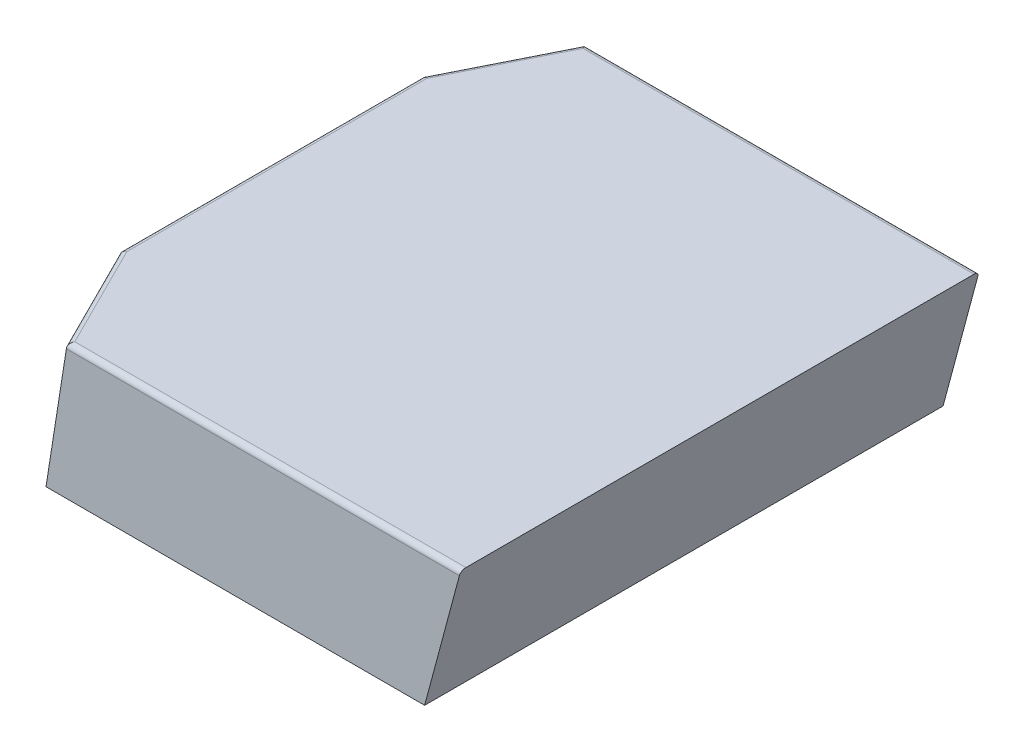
ISO-10303-21;
HEADER;
FILE_DESCRIPTION(('STEP AP214'),'2;1');
FILE_NAME('part.step','',(''),(''),'','','');
FILE_SCHEMA(('AUTOMOTIVE_DESIGN { 1 0 10303 214 1 1 1 1 }'));
ENDSEC;
DATA;
#1=APPLICATION_CONTEXT('core data for automotive mechanical design processes');
#2=APPLICATION_PROTOCOL_DEFINITION('international standard','automotive_design',2000,#1);
#3=PRODUCT_CONTEXT('',#1,'mechanical');
#4=PRODUCT('Part','Part','',(#3));
#5=PRODUCT_RELATED_PRODUCT_CATEGORY('part','',(#4));
#6=PRODUCT_DEFINITION_FORMATION('','',#4);
#7=PRODUCT_DEFINITION_CONTEXT('part definition',#1,'design');
#8=PRODUCT_DEFINITION('design','',#6,#7);
#9=PRODUCT_DEFINITION_SHAPE('','',#8);
#10=(LENGTH_UNIT() NAMED_UNIT(*) SI_UNIT(.MILLI.,.METRE.));
#11=(NAMED_UNIT(*) PLANE_ANGLE_UNIT() SI_UNIT($,.RADIAN.));
#12=(NAMED_UNIT(*) SI_UNIT($,.STERADIAN.) SOLID_ANGLE_UNIT());
#13=UNCERTAINTY_MEASURE_WITH_UNIT(LENGTH_MEASURE(1.E-05),#10,'distance_accuracy_value','');
#14=(GEOMETRIC_REPRESENTATION_CONTEXT(3) GLOBAL_UNCERTAINTY_ASSIGNED_CONTEXT((#13)) GLOBAL_UNIT_ASSIGNED_CONTEXT((#10,
#11,#12)) REPRESENTATION_CONTEXT('',''));
#15=CARTESIAN_POINT('',(0.,0.,0.));
#16=DIRECTION('',(0.,0.,1.));
#17=DIRECTION('',(1.,0.,0.));
#18=AXIS2_PLACEMENT_3D('',#15,#16,#17);
#19=CARTESIAN_POINT('',(0.,-260.,1000.));
#20=DIRECTION('',(0.,1.,0.));
#21=DIRECTION('',(0.,0.,1.));
#22=AXIS2_PLACEMENT_3D('',#19,#20,#21);
#23=PLANE('',#22);
#24=DIRECTION('',(0.,0.,-1.));
#25=VECTOR('',#24,1.);
#26=CARTESIAN_POINT('',(0.,-260.,1000.));
#27=LINE('',#26,#25);
#28=CARTESIAN_POINT('',(0.,-260.,800.));
#29=VERTEX_POINT('',#28);
#30=CARTESIAN_POINT('',(0.,-260.,200.));
#31=VERTEX_POINT('',#30);
#32=EDGE_CURVE('E117',#29,#31,#27,.T.);
#33=ORIENTED_EDGE('',*,*,#32,.T.);
#34=DIRECTION('',(-0.447213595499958,0.,0.894427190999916));
#35=VECTOR('',#34,1.);
#36=CARTESIAN_POINT('',(100.,-260.,0.));
#37=LINE('',#36,#35);
#38=CARTESIAN_POINT('',(100.,-260.,0.));
#39=VERTEX_POINT('',#38);
#40=EDGE_CURVE('E127',#39,#31,#37,.T.);
#41=ORIENTED_EDGE('',*,*,#40,.F.);
#42=DIRECTION('',(1.,0.,0.));
#43=VECTOR('',#42,1.);
#44=CARTESIAN_POINT('',(0.,-260.,0.));
#45=LINE('',#44,#43);
#46=CARTESIAN_POINT('',(830.333209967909,-260.,0.));
#47=VERTEX_POINT('',#46);
#48=EDGE_CURVE('E185',#39,#47,#45,.T.);
#49=ORIENTED_EDGE('',*,*,#48,.T.);
#50=DIRECTION('',(0.,0.,-1.));
#51=VECTOR('',#50,1.);
#52=CARTESIAN_POINT('',(830.333209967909,-260.,1000.));
#53=LINE('',#52,#51);
#54=CARTESIAN_POINT('',(830.333209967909,-260.,1000.));
#55=VERTEX_POINT('',#54);
#56=EDGE_CURVE('E137',#55,#47,#53,.T.);
#57=ORIENTED_EDGE('',*,*,#56,.F.);
#58=DIRECTION('',(1.,0.,0.));
#59=VECTOR('',#58,1.);
#60=CARTESIAN_POINT('',(0.,-260.,1000.));
#61=LINE('',#60,#59);
#62=CARTESIAN_POINT('',(100.,-260.,1000.));
#63=VERTEX_POINT('',#62);
#64=EDGE_CURVE('E186',#63,#55,#61,.T.);
#65=ORIENTED_EDGE('',*,*,#64,.F.);
#66=DIRECTION('',(0.447213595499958,0.,0.894427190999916));
#67=VECTOR('',#66,1.);
#68=CARTESIAN_POINT('',(100.,-260.,1000.));
#69=LINE('',#68,#67);
#70=EDGE_CURVE('E132',#29,#63,#69,.T.);
#71=ORIENTED_EDGE('',*,*,#70,.F.);
#72=EDGE_LOOP('',(#33,#41,#49,#57,#65,#71));
#73=FACE_BOUND('',#72,.T.);
#74=ADVANCED_FACE('F33',(#73),#23,.F.);
#75=CARTESIAN_POINT('',(830.333209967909,-260.,1000.));
#76=DIRECTION('',(-0.965925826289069,0.258819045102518,0.));
#77=DIRECTION('',(-0.258819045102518,-0.965925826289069,0.));
#78=AXIS2_PLACEMENT_3D('',#75,#76,#77);
#79=PLANE('',#78);
#80=DIRECTION('',(0.258819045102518,0.965925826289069,0.));
#81=VECTOR('',#80,1.);
#82=CARTESIAN_POINT('',(830.333209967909,-260.,0.));
#83=LINE('',#82,#81);
#84=CARTESIAN_POINT('',(897.320508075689,-9.99999999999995,0.));
#85=VERTEX_POINT('',#84);
#86=EDGE_CURVE('E189',#47,#85,#83,.T.);
#87=ORIENTED_EDGE('',*,*,#86,.T.);
#88=CARTESIAN_POINT('',(897.320508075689,-10.,10.));
#89=DIRECTION('',(-0.965925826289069,0.258819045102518,0.));
#90=DIRECTION('',(-0.258819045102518,-0.965925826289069,0.));
#91=AXIS2_PLACEMENT_3D('',#88,#89,#90);
#92=ELLIPSE('',#91,10.3527618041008,10.);
#93=CARTESIAN_POINT('',(900.,0.,10.));
#94=VERTEX_POINT('',#93);
#95=EDGE_CURVE('E164',#85,#94,#92,.F.);
#96=ORIENTED_EDGE('',*,*,#95,.T.);
#97=DIRECTION('',(0.,0.,-1.));
#98=VECTOR('',#97,1.);
#99=CARTESIAN_POINT('',(900.,0.,1000.));
#100=LINE('',#99,#98);
#101=CARTESIAN_POINT('',(900.,0.,990.));
#102=VERTEX_POINT('',#101);
#103=EDGE_CURVE('E141',#102,#94,#100,.T.);
#104=ORIENTED_EDGE('',*,*,#103,.F.);
#105=CARTESIAN_POINT('',(897.320508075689,-10.,990.));
#106=DIRECTION('',(-0.965925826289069,0.258819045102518,0.));
#107=DIRECTION('',(0.258819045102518,0.965925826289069,0.));
#108=AXIS2_PLACEMENT_3D('',#105,#106,#107);
#109=ELLIPSE('',#108,10.3527618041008,10.);
#110=CARTESIAN_POINT('',(897.320508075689,-9.99999999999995,1000.));
#111=VERTEX_POINT('',#110);
#112=EDGE_CURVE('E162',#102,#111,#109,.F.);
#113=ORIENTED_EDGE('',*,*,#112,.T.);
#114=DIRECTION('',(0.258819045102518,0.965925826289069,0.));
#115=VECTOR('',#114,1.);
#116=CARTESIAN_POINT('',(830.333209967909,-260.,1000.));
#117=LINE('',#116,#115);
#118=EDGE_CURVE('E188',#55,#111,#117,.T.);
#119=ORIENTED_EDGE('',*,*,#118,.F.);
#120=ORIENTED_EDGE('',*,*,#56,.T.);
#121=EDGE_LOOP('',(#87,#96,#104,#113,#119,#120));
#122=FACE_BOUND('',#121,.T.);
#123=ADVANCED_FACE('F217',(#122),#79,.F.);
#124=CARTESIAN_POINT('',(0.,0.,1000.));
#125=DIRECTION('',(0.,-1.,0.));
#126=DIRECTION('',(0.,0.,-1.));
#127=AXIS2_PLACEMENT_3D('',#124,#125,#126);
#128=PLANE('',#127);
#129=ORIENTED_EDGE('',*,*,#103,.T.);
#130=DIRECTION('',(-1.,0.,0.));
#131=VECTOR('',#130,1.);
#132=CARTESIAN_POINT('',(0.,0.,10.));
#133=LINE('',#132,#131);
#134=CARTESIAN_POINT('',(145.572572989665,0.,10.));
#135=VERTEX_POINT('',#134);
#136=EDGE_CURVE('E153',#94,#135,#133,.T.);
#137=ORIENTED_EDGE('',*,*,#136,.T.);
#138=DIRECTION('',(-0.447213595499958,0.,0.894427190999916));
#139=VECTOR('',#138,1.);
#140=CARTESIAN_POINT('',(-279.541941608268,0.,860.229029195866));
#141=LINE('',#140,#139);
#142=CARTESIAN_POINT('',(45.2334844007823,0.,210.678177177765));
#143=VERTEX_POINT('',#142);
#144=EDGE_CURVE('E151',#135,#143,#141,.T.);
#145=ORIENTED_EDGE('',*,*,#144,.T.);
#146=DIRECTION('',(0.,0.,1.));
#147=VECTOR('',#146,1.);
#148=CARTESIAN_POINT('',(45.2334844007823,0.,1000.));
#149=LINE('',#148,#147);
#150=CARTESIAN_POINT('',(45.2334844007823,0.,789.321822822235));
#151=VERTEX_POINT('',#150);
#152=EDGE_CURVE('E149',#143,#151,#149,.T.);
#153=ORIENTED_EDGE('',*,*,#152,.T.);
#154=DIRECTION('',(0.447213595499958,0.,0.894427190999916));
#155=VECTOR('',#154,1.);
#156=CARTESIAN_POINT('',(120.458058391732,0.,939.770970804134));
#157=LINE('',#156,#155);
#158=CARTESIAN_POINT('',(145.572572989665,0.,990.));
#159=VERTEX_POINT('',#158);
#160=EDGE_CURVE('E147',#151,#159,#157,.T.);
#161=ORIENTED_EDGE('',*,*,#160,.T.);
#162=DIRECTION('',(-1.,0.,0.));
#163=VECTOR('',#162,1.);
#164=CARTESIAN_POINT('',(900.,0.,990.));
#165=LINE('',#164,#163);
#166=EDGE_CURVE('E123',#159,#102,#165,.F.);
#167=ORIENTED_EDGE('',*,*,#166,.T.);
#168=EDGE_LOOP('',(#129,#137,#145,#153,#161,#167));
#169=FACE_BOUND('',#168,.T.);
#170=ADVANCED_FACE('F197',(#169),#128,.F.);
#171=CARTESIAN_POINT('',(0.,0.,1000.));
#172=DIRECTION('',(0.,0.,1.));
#173=DIRECTION('',(1.,0.,0.));
#174=AXIS2_PLACEMENT_3D('',#171,#172,#173);
#175=PLANE('',#174);
#176=ORIENTED_EDGE('',*,*,#118,.T.);
#177=DIRECTION('',(-1.,0.,0.));
#178=VECTOR('',#177,1.);
#179=CARTESIAN_POINT('',(140.853651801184,-10.,1000.));
#180=LINE('',#179,#178);
#181=CARTESIAN_POINT('',(139.282357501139,-10.,1000.));
#182=VERTEX_POINT('',#181);
#183=EDGE_CURVE('E11',#111,#182,#180,.T.);
#184=ORIENTED_EDGE('',*,*,#183,.T.);
#185=DIRECTION('',(0.155224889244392,0.987879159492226,0.));
#186=VECTOR('',#185,1.);
#187=CARTESIAN_POINT('',(137.459815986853,-21.5989825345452,1000.));
#188=LINE('',#187,#186);
#189=EDGE_CURVE('E136',#63,#182,#188,.T.);
#190=ORIENTED_EDGE('',*,*,#189,.F.);
#191=ORIENTED_EDGE('',*,*,#64,.T.);
#192=EDGE_LOOP('',(#176,#184,#190,#191));
#193=FACE_BOUND('',#192,.T.);
#194=ADVANCED_FACE('F218',(#193),#175,.T.);
#195=CARTESIAN_POINT('',(0.,0.,0.));
#196=DIRECTION('',(0.,0.,1.));
#197=DIRECTION('',(1.,0.,0.));
#198=AXIS2_PLACEMENT_3D('',#195,#196,#197);
#199=PLANE('',#198);
#200=DIRECTION('',(0.155224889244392,0.987879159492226,0.));
#201=VECTOR('',#200,1.);
#202=CARTESIAN_POINT('',(137.459815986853,-21.5989825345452,0.));
#203=LINE('',#202,#201);
#204=CARTESIAN_POINT('',(139.282357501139,-10.,0.));
#205=VERTEX_POINT('',#204);
#206=EDGE_CURVE('E124',#39,#205,#203,.T.);
#207=ORIENTED_EDGE('',*,*,#206,.T.);
#208=DIRECTION('',(-1.,0.,0.));
#209=VECTOR('',#208,1.);
#210=CARTESIAN_POINT('',(0.,-10.,0.));
#211=LINE('',#210,#209);
#212=EDGE_CURVE('E160',#205,#85,#211,.F.);
#213=ORIENTED_EDGE('',*,*,#212,.T.);
#214=ORIENTED_EDGE('',*,*,#86,.F.);
#215=ORIENTED_EDGE('',*,*,#48,.F.);
#216=EDGE_LOOP('',(#207,#213,#214,#215));
#217=FACE_BOUND('',#216,.T.);
#218=ADVANCED_FACE('F213',(#217),#199,.F.);
#219=CARTESIAN_POINT('',(100.,-260.,1000.));
#220=DIRECTION('',(0.885722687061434,-0.139173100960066,-0.442861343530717));
#221=DIRECTION('',(-0.447213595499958,0.,-0.894427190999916));
#222=AXIS2_PLACEMENT_3D('',#219,#220,#221);
#223=PLANE('',#222);
#224=CARTESIAN_POINT('',(134.282357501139,-10.,990.));
#225=DIRECTION('',(0.885722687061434,-0.139173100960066,-0.442861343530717));
#226=DIRECTION('',(0.464214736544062,0.265542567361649,0.844980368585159));
#227=AXIS2_PLACEMENT_3D('',#224,#225,#226);
#228=ELLIPSE('',#227,11.2902154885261,10.);
#229=CARTESIAN_POINT('',(139.452379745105,-8.60826899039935,999.902680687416));
#230=VERTEX_POINT('',#229);
#231=EDGE_CURVE('E50',#182,#230,#228,.F.);
#232=ORIENTED_EDGE('',*,*,#231,.T.);
#233=DIRECTION('',(0.447213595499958,0.,0.894427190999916));
#234=VECTOR('',#233,1.);
#235=CARTESIAN_POINT('',(131.600831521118,-8.6082689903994,984.199584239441));
#236=LINE('',#235,#234);
#237=CARTESIAN_POINT('',(35.3308037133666,-8.60826899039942,791.659528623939));
#238=VERTEX_POINT('',#237);
#239=EDGE_CURVE('E42',#230,#238,#236,.F.);
#240=ORIENTED_EDGE('',*,*,#239,.T.);
#241=DIRECTION('',(-0.139098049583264,-0.989734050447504,0.0328365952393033));
#242=VECTOR('',#241,1.);
#243=CARTESIAN_POINT('',(1.02132546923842,-252.732891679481,799.758897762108));
#244=LINE('',#243,#242);
#245=EDGE_CURVE('E133',#238,#29,#244,.T.);
#246=ORIENTED_EDGE('',*,*,#245,.T.);
#247=ORIENTED_EDGE('',*,*,#70,.T.);
#248=ORIENTED_EDGE('',*,*,#189,.T.);
#249=EDGE_LOOP('',(#232,#240,#246,#247,#248));
#250=FACE_BOUND('',#249,.T.);
#251=ADVANCED_FACE('F221',(#250),#223,.F.);
#252=CARTESIAN_POINT('',(100.,-260.,0.));
#253=DIRECTION('',(0.885722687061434,-0.139173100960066,0.442861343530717));
#254=DIRECTION('',(0.447213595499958,0.,-0.894427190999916));
#255=AXIS2_PLACEMENT_3D('',#252,#253,#254);
#256=PLANE('',#255);
#257=DIRECTION('',(-0.447213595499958,0.,0.894427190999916));
#258=VECTOR('',#257,1.);
#259=CARTESIAN_POINT('',(131.600831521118,-8.60826899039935,15.8004157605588));
#260=LINE('',#259,#258);
#261=CARTESIAN_POINT('',(35.3308037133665,-8.60826899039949,208.340471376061));
#262=VERTEX_POINT('',#261);
#263=CARTESIAN_POINT('',(139.452379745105,-8.60826899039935,0.0973193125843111));
#264=VERTEX_POINT('',#263);
#265=EDGE_CURVE('E156',#262,#264,#260,.F.);
#266=ORIENTED_EDGE('',*,*,#265,.T.);
#267=CARTESIAN_POINT('',(134.282357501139,-10.,10.));
#268=DIRECTION('',(0.885722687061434,-0.139173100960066,0.442861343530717));
#269=DIRECTION('',(-0.464214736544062,-0.265542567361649,0.844980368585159));
#270=AXIS2_PLACEMENT_3D('',#267,#268,#269);
#271=ELLIPSE('',#270,11.2902154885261,10.);
#272=EDGE_CURVE('E158',#264,#205,#271,.F.);
#273=ORIENTED_EDGE('',*,*,#272,.T.);
#274=ORIENTED_EDGE('',*,*,#206,.F.);
#275=ORIENTED_EDGE('',*,*,#40,.T.);
#276=DIRECTION('',(0.139098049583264,0.989734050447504,0.0328365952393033));
#277=VECTOR('',#276,1.);
#278=CARTESIAN_POINT('',(1.02132546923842,-252.732891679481,200.241102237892));
#279=LINE('',#278,#277);
#280=EDGE_CURVE('E112',#31,#262,#279,.T.);
#281=ORIENTED_EDGE('',*,*,#280,.T.);
#282=EDGE_LOOP('',(#266,#273,#274,#275,#281));
#283=FACE_BOUND('',#282,.T.);
#284=ADVANCED_FACE('F128',(#283),#256,.F.);
#285=CARTESIAN_POINT('',(0.,-260.,0.));
#286=DIRECTION('',(0.990268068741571,-0.139173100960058,0.));
#287=DIRECTION('',(0.139173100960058,0.990268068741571,0.));
#288=AXIS2_PLACEMENT_3D('',#285,#286,#287);
#289=PLANE('',#288);
#290=ORIENTED_EDGE('',*,*,#245,.F.);
#291=DIRECTION('',(0.,0.,1.));
#292=VECTOR('',#291,1.);
#293=CARTESIAN_POINT('',(35.3308037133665,-8.6082689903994,0.));
#294=LINE('',#293,#292);
#295=EDGE_CURVE('E120',#238,#262,#294,.F.);
#296=ORIENTED_EDGE('',*,*,#295,.T.);
#297=ORIENTED_EDGE('',*,*,#280,.F.);
#298=ORIENTED_EDGE('',*,*,#32,.F.);
#299=EDGE_LOOP('',(#290,#296,#297,#298));
#300=FACE_BOUND('',#299,.T.);
#301=ADVANCED_FACE('F115',(#300),#289,.F.);
#302=CARTESIAN_POINT('',(0.,-10.,990.));
#303=DIRECTION('',(1.,0.,0.));
#304=DIRECTION('',(0.,0.,-1.));
#305=AXIS2_PLACEMENT_3D('',#302,#303,#304);
#306=CYLINDRICAL_SURFACE('',#305,10.);
#307=ORIENTED_EDGE('',*,*,#112,.F.);
#308=ORIENTED_EDGE('',*,*,#166,.F.);
#309=CARTESIAN_POINT('',(145.572572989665,-10.,990.));
#310=DIRECTION('',(0.85065080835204,0.,0.525731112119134));
#311=DIRECTION('',(0.525731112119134,0.,-0.85065080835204));
#312=AXIS2_PLACEMENT_3D('',#309,#310,#311);
#313=ELLIPSE('',#312,11.7557050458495,10.);
#314=EDGE_CURVE('E37',#230,#159,#313,.F.);
#315=ORIENTED_EDGE('',*,*,#314,.F.);
#316=ORIENTED_EDGE('',*,*,#231,.F.);
#317=ORIENTED_EDGE('',*,*,#183,.F.);
#318=EDGE_LOOP('',(#307,#308,#315,#316,#317));
#319=FACE_BOUND('',#318,.T.);
#320=ADVANCED_FACE('F35',(#319),#306,.T.);
#321=CARTESIAN_POINT('',(120.458058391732,-10.,939.770970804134));
#322=DIRECTION('',(0.447213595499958,0.,0.894427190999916));
#323=DIRECTION('',(0.894427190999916,0.,-0.447213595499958));
#324=AXIS2_PLACEMENT_3D('',#321,#322,#323);
#325=CYLINDRICAL_SURFACE('',#324,10.);
#326=ORIENTED_EDGE('',*,*,#314,.T.);
#327=ORIENTED_EDGE('',*,*,#160,.F.);
#328=CARTESIAN_POINT('',(45.2334844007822,-10.,789.321822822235));
#329=DIRECTION('',(0.229752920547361,0.,0.97324898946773));
#330=DIRECTION('',(0.97324898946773,0.,-0.229752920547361));
#331=AXIS2_PLACEMENT_3D('',#328,#329,#330);
#332=ELLIPSE('',#331,10.2748629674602,10.);
#333=EDGE_CURVE('E173',#238,#151,#332,.F.);
#334=ORIENTED_EDGE('',*,*,#333,.F.);
#335=ORIENTED_EDGE('',*,*,#239,.F.);
#336=EDGE_LOOP('',(#326,#327,#334,#335));
#337=FACE_BOUND('',#336,.T.);
#338=ADVANCED_FACE('F220',(#337),#325,.T.);
#339=CARTESIAN_POINT('',(45.2334844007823,-10.,1000.));
#340=DIRECTION('',(0.,0.,1.));
#341=DIRECTION('',(1.,0.,0.));
#342=AXIS2_PLACEMENT_3D('',#339,#340,#341);
#343=CYLINDRICAL_SURFACE('',#342,10.);
#344=ORIENTED_EDGE('',*,*,#333,.T.);
#345=ORIENTED_EDGE('',*,*,#152,.F.);
#346=CARTESIAN_POINT('',(45.2334844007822,-10.,210.678177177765));
#347=DIRECTION('',(-0.229752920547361,0.,0.97324898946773));
#348=DIRECTION('',(0.97324898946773,0.,0.229752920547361));
#349=AXIS2_PLACEMENT_3D('',#346,#347,#348);
#350=ELLIPSE('',#349,10.2748629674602,10.);
#351=EDGE_CURVE('E171',#262,#143,#350,.F.);
#352=ORIENTED_EDGE('',*,*,#351,.F.);
#353=ORIENTED_EDGE('',*,*,#295,.F.);
#354=EDGE_LOOP('',(#344,#345,#352,#353));
#355=FACE_BOUND('',#354,.T.);
#356=ADVANCED_FACE('F211',(#355),#343,.T.);
#357=CARTESIAN_POINT('',(-279.541941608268,-10.,860.229029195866));
#358=DIRECTION('',(-0.447213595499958,0.,0.894427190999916));
#359=DIRECTION('',(0.894427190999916,0.,0.447213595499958));
#360=AXIS2_PLACEMENT_3D('',#357,#358,#359);
#361=CYLINDRICAL_SURFACE('',#360,10.);
#362=ORIENTED_EDGE('',*,*,#351,.T.);
#363=ORIENTED_EDGE('',*,*,#144,.F.);
#364=CARTESIAN_POINT('',(145.572572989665,-10.,10.));
#365=DIRECTION('',(-0.85065080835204,0.,0.525731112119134));
#366=DIRECTION('',(0.525731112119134,0.,0.85065080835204));
#367=AXIS2_PLACEMENT_3D('',#364,#365,#366);
#368=ELLIPSE('',#367,11.7557050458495,10.);
#369=EDGE_CURVE('E169',#264,#135,#368,.F.);
#370=ORIENTED_EDGE('',*,*,#369,.F.);
#371=ORIENTED_EDGE('',*,*,#265,.F.);
#372=EDGE_LOOP('',(#362,#363,#370,#371));
#373=FACE_BOUND('',#372,.T.);
#374=ADVANCED_FACE('F210',(#373),#361,.T.);
#375=CARTESIAN_POINT('',(0.,-10.,10.));
#376=DIRECTION('',(-1.,0.,0.));
#377=DIRECTION('',(0.,0.,1.));
#378=AXIS2_PLACEMENT_3D('',#375,#376,#377);
#379=CYLINDRICAL_SURFACE('',#378,10.);
#380=ORIENTED_EDGE('',*,*,#95,.F.);
#381=ORIENTED_EDGE('',*,*,#212,.F.);
#382=ORIENTED_EDGE('',*,*,#272,.F.);
#383=ORIENTED_EDGE('',*,*,#369,.T.);
#384=ORIENTED_EDGE('',*,*,#136,.F.);
#385=EDGE_LOOP('',(#380,#381,#382,#383,#384));
#386=FACE_BOUND('',#385,.T.);
#387=ADVANCED_FACE('F203',(#386),#379,.T.);
#388=CLOSED_SHELL('',(#74,#123,#170,#194,#218,#251,#284,#301,#320,#338,#356,#374,#387));
#389=MANIFOLD_SOLID_BREP('B2',#388);
#390=ADVANCED_BREP_SHAPE_REPRESENTATION('',(#18,#389),#14);
#391=SHAPE_DEFINITION_REPRESENTATION(#9,#390);
ENDSEC;
END-ISO-10303-21;
